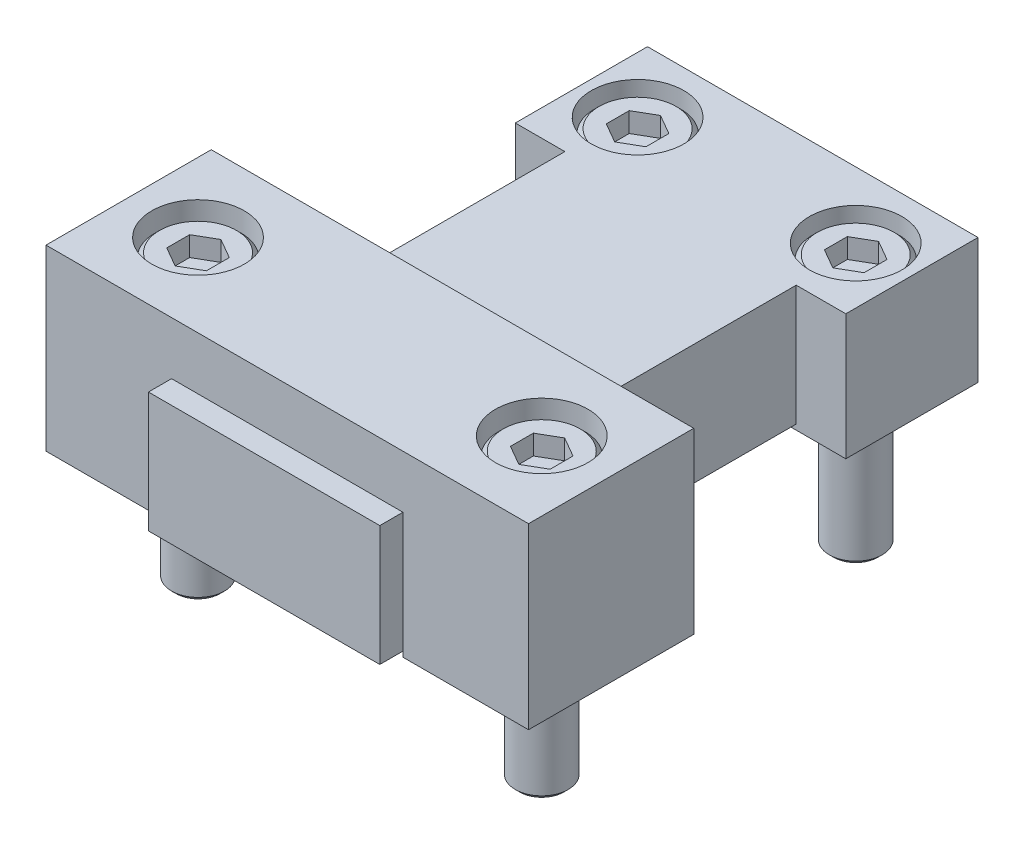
from build123d import *

# Parameters (mm, degrees)
SKETCH1_W               = 73
SKETCH1_H               = 25
TOP_BLOCK_DEPTH         = 27
SKETCH2_W               = 35
SKETCH2_H               = 19
TOB_BLOCK_CHANNEL_DEPTH = 52.829045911
EXTRUDE4_DEPTH          = 18.2
SKETCH5_R               = 7
EXTRUDE5_DEPTH          = 9.5
SKETCH16_W              = 50
SKETCH16_H              = 20
EXTRUDE15_DEPTH         = 0.8
SKETCH6_R               = 4.5
EXTRUDE6_DEPTH          = 79.278349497
SKETCH7_R               = 7
EXTRUDE7_DEPTH          = 10
SKETCH8_R               = 4.5
EXTRUDE8_DEPTH          = 79.168088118
SKETCH9_R               = 6.5
EXTRUDE9_DEPTH          = 8
SKETCH12_R              = 6.5
EXTRUDE12_DEPTH         = 8
SKETCH10_R              = 4
EXTRUDE10_DEPTH         = 35
EXTRUDE11_DEPTH         = 3
CHAMFER2_SIZE           = 0.667
EXTRUDE13_DEPTH         = 3
SKETCH14_R              = 4
EXTRUDE14_DEPTH         = 30
CHAMFER3_SIZE           = 0.667


with BuildPart() as part:
    # Sketch1 → Top BLock (new body)
    with BuildSketch(Plane(origin=(0, 0, 0), x_dir=(1, 0, 0), z_dir=(0, 1, 0))):
        Rectangle(SKETCH1_W, SKETCH1_H)
    extrude(amount=-TOP_BLOCK_DEPTH)

    # Sketch2 → Tob Block Channel (cut, through all)
    with BuildSketch(Plane.XY.offset(12.5)):
        with Locations((0, -17.5)):
            Rectangle(SKETCH2_W, SKETCH2_H)
    extrude(amount=-TOB_BLOCK_CHANNEL_DEPTH, mode=Mode.SUBTRACT)

    # Sketch7 → Extrude7 (cut)
    with BuildSketch(Plane(origin=(0, 0, 0), x_dir=(1, 0, 0), z_dir=(0, 1, 0))):
        with Locations(Location((-26, 0, 0), (0, 0, 270))):
            Circle(SKETCH7_R)
        with Locations(Location((26, 0, 0), (0, 0, 270))):
            Circle(SKETCH7_R)
    extrude(amount=-EXTRUDE7_DEPTH, mode=Mode.SUBTRACT)

    # Sketch8 → Extrude8 (cut, through all)
    with BuildSketch(Plane(origin=(0, -10, 0), x_dir=(1, 0, 0), z_dir=(0, 1, 0))):
        with Locations(Location((-26, 0, 0), (0, 0, 270))):
            Circle(SKETCH8_R)
        with Locations(Location((26, 0, 0), (0, 0, 270))):
            Circle(SKETCH8_R)
    extrude(amount=-EXTRUDE8_DEPTH, mode=Mode.SUBTRACT)


with BuildPart() as body_2:
    # Sketch4 → Extrude4 (new body)
    with BuildSketch(Plane.XZ.offset(8)):
        Polygon((17.5, -47), (25, -47), (25, -67), (-25, -67), (-25, -47), (-17.5, -47), (-17.5, 16), (17.5, 16), align=None)
    extrude(amount=EXTRUDE4_DEPTH)

    # Sketch5 → Extrude5 (cut)
    with BuildSketch(Plane(origin=(0, -8, 0), x_dir=(1, 0, 0), z_dir=(0, 1, 0))):
        with Locations(Location((-16.5, 57, 0), (0, 0, 270))):
            Circle(SKETCH5_R)
        with Locations(Location((16.5, 57, 0), (0, 0, 270))):
            Circle(SKETCH5_R)
    extrude(amount=-EXTRUDE5_DEPTH, mode=Mode.SUBTRACT)

    # Sketch16 → Extrude15 (add)
    with BuildSketch(Plane.XZ.offset(26.2)):
        with Locations((0, -57)):
            Rectangle(SKETCH16_W, SKETCH16_H)
    extrude(amount=EXTRUDE15_DEPTH)

    # Sketch6 → Extrude6 (cut, through all)
    with BuildSketch(Plane(origin=(0, -17.5, 0), x_dir=(1, 0, 0), z_dir=(0, 1, 0))):
        with Locations(Location((-16.5, 57, 0), (0, 0, 270))):
            Circle(SKETCH6_R)
        with Locations(Location((16.5, 57, 0), (0, 0, 270))):
            Circle(SKETCH6_R)
    extrude(amount=-EXTRUDE6_DEPTH, mode=Mode.SUBTRACT)


with BuildPart() as body_3:
    # Sketch9 → Extrude9 (new body)
    with BuildSketch(Plane(origin=(0, -10, 0), x_dir=(1, 0, 0), z_dir=(0, 1, 0))):
        with Locations(Location((26, 0, 0), (0, 0, 270))):
            Circle(SKETCH9_R)
    extrude(amount=EXTRUDE9_DEPTH)

    # Sketch10 → Extrude10 (add)
    with BuildSketch(Plane.XZ.offset(10)):
        with Locations(Location((26, 0, 0), (0, 0, 90))):
            Circle(SKETCH10_R)
    extrude(amount=EXTRUDE10_DEPTH)

    # Sketch11 → Extrude11 (cut)
    with BuildSketch(Plane(origin=(0, -2, 0), x_dir=(1, 0, 0), z_dir=(0, 1, 0))):
        Polygon((29, 1.732050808), (26, 3.464101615), (23, 1.732050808), (23, -1.732050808), (26, -3.464101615), (29, -1.732050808), align=None)
    extrude(amount=-EXTRUDE11_DEPTH, mode=Mode.SUBTRACT)

    # Chamfer2
    chamfer2_edges = [body_3.edges().sort_by_distance(p)[0] for p in [
        (26, -2, -6.5),
        (26, -45, -4),
    ]]
    chamfer(chamfer2_edges, length=CHAMFER2_SIZE)


with BuildPart() as body_4:
    # Sketch12 → Extrude12 (new body)
    with BuildSketch(Plane(origin=(0, -17.5, 0), x_dir=(1, 0, 0), z_dir=(0, 1, 0))):
        with Locations(Location((16.5, 57, 0), (0, 0, 270))):
            Circle(SKETCH12_R)
    extrude(amount=EXTRUDE12_DEPTH)

    # Sketch13 → Extrude13 (cut)
    with BuildSketch(Plane(origin=(0, -9.5, 0), x_dir=(1, 0, 0), z_dir=(0, 1, 0))):
        Polygon((16.5, 53.535898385), (19.5, 55.267949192), (19.5, 58.732050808), (16.5, 60.464101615), (13.5, 58.732050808), (13.5, 55.267949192), align=None)
    extrude(amount=-EXTRUDE13_DEPTH, mode=Mode.SUBTRACT)

    # Sketch14 → Extrude14 (add)
    with BuildSketch(Plane.XZ.offset(17.5)):
        with Locations(Location((16.5, -57, 0), (0, 0, 90))):
            Circle(SKETCH14_R)
    extrude(amount=EXTRUDE14_DEPTH)

    # Chamfer3
    chamfer3_edges = [body_4.edges().sort_by_distance(p)[0] for p in [
        (16.5, -47.5, -61),
        (16.5, -9.5, -63.5),
    ]]
    chamfer(chamfer3_edges, length=CHAMFER3_SIZE)


with BuildPart() as body_5:
    # Mirror1: mirrored copy
    add(body_3.part.mirror(Plane(origin=(0, 0, 0), x_dir=(0, 0, 1), z_dir=(1, 0, 0))))


with BuildPart() as body_6:
    # Mirror2: mirrored copy
    add(body_4.part.mirror(Plane(origin=(0, 0, 0), x_dir=(0, 0, 1), z_dir=(1, 0, 0))))


solid = Compound([part.part, body_2.part, body_3.part, body_4.part, body_5.part, body_6.part])
